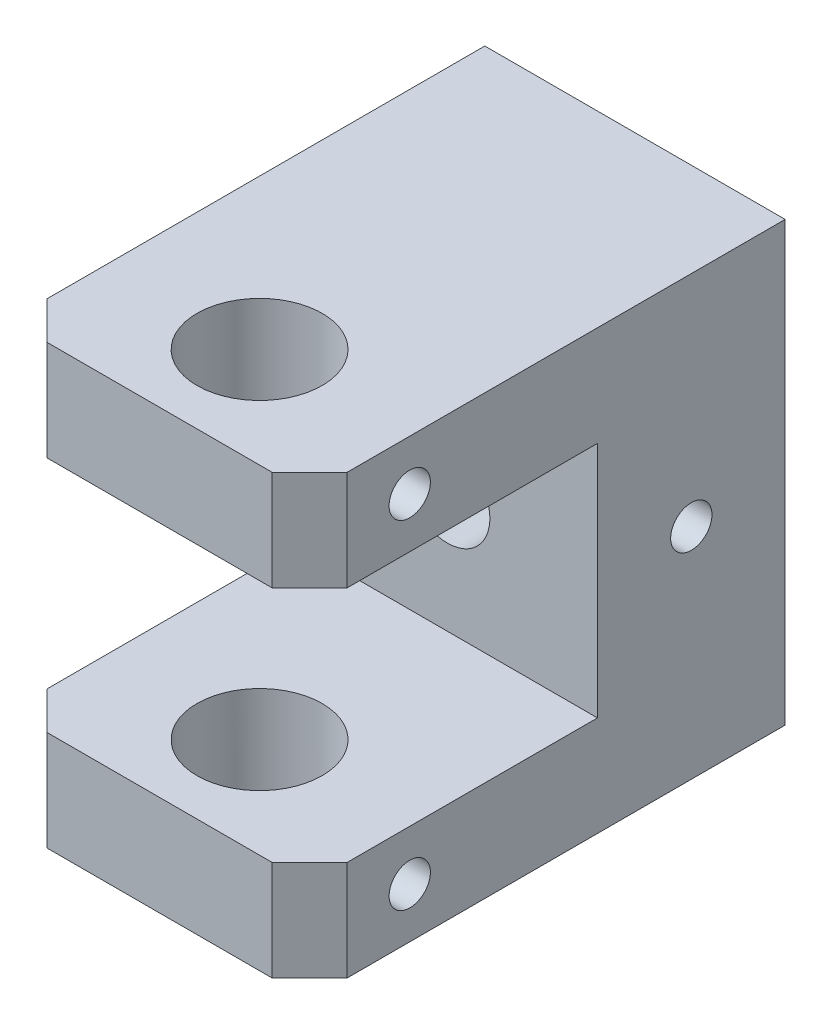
ISO-10303-21;
HEADER;
FILE_DESCRIPTION(('STEP AP214'),'2;1');
FILE_NAME('part.step','',(''),(''),'','','');
FILE_SCHEMA(('AUTOMOTIVE_DESIGN { 1 0 10303 214 1 1 1 1 }'));
ENDSEC;
DATA;
#1=APPLICATION_CONTEXT('core data for automotive mechanical design processes');
#2=APPLICATION_PROTOCOL_DEFINITION('international standard','automotive_design',2000,#1);
#3=PRODUCT_CONTEXT('',#1,'mechanical');
#4=PRODUCT('Part','Part','',(#3));
#5=PRODUCT_RELATED_PRODUCT_CATEGORY('part','',(#4));
#6=PRODUCT_DEFINITION_FORMATION('','',#4);
#7=PRODUCT_DEFINITION_CONTEXT('part definition',#1,'design');
#8=PRODUCT_DEFINITION('design','',#6,#7);
#9=PRODUCT_DEFINITION_SHAPE('','',#8);
#10=(LENGTH_UNIT() NAMED_UNIT(*) SI_UNIT(.MILLI.,.METRE.));
#11=(NAMED_UNIT(*) PLANE_ANGLE_UNIT() SI_UNIT($,.RADIAN.));
#12=(NAMED_UNIT(*) SI_UNIT($,.STERADIAN.) SOLID_ANGLE_UNIT());
#13=UNCERTAINTY_MEASURE_WITH_UNIT(LENGTH_MEASURE(1.E-05),#10,'distance_accuracy_value','');
#14=(GEOMETRIC_REPRESENTATION_CONTEXT(3) GLOBAL_UNCERTAINTY_ASSIGNED_CONTEXT((#13)) GLOBAL_UNIT_ASSIGNED_CONTEXT((#10,
#11,#12)) REPRESENTATION_CONTEXT('',''));
#15=CARTESIAN_POINT('',(0.,0.,0.));
#16=DIRECTION('',(0.,0.,1.));
#17=DIRECTION('',(1.,0.,0.));
#18=AXIS2_PLACEMENT_3D('',#15,#16,#17);
#19=CARTESIAN_POINT('',(-12.,17.5,38.));
#20=DIRECTION('',(0.,0.,-1.));
#21=DIRECTION('',(-1.,0.,0.));
#22=AXIS2_PLACEMENT_3D('',#19,#20,#21);
#23=PLANE('',#22);
#24=DIRECTION('',(1.,0.,0.));
#25=VECTOR('',#24,1.);
#26=CARTESIAN_POINT('',(-12.,17.5,38.));
#27=LINE('',#26,#25);
#28=CARTESIAN_POINT('',(-9.,17.5,38.));
#29=VERTEX_POINT('',#28);
#30=CARTESIAN_POINT('',(8.99999999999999,17.5,38.));
#31=VERTEX_POINT('',#30);
#32=EDGE_CURVE('E171',#29,#31,#27,.T.);
#33=ORIENTED_EDGE('',*,*,#32,.F.);
#34=DIRECTION('',(0.,-1.,0.));
#35=VECTOR('',#34,1.);
#36=CARTESIAN_POINT('',(-9.,17.5,38.));
#37=LINE('',#36,#35);
#38=CARTESIAN_POINT('',(-9.00000000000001,9.49999999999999,38.));
#39=VERTEX_POINT('',#38);
#40=EDGE_CURVE('E218',#29,#39,#37,.T.);
#41=ORIENTED_EDGE('',*,*,#40,.T.);
#42=DIRECTION('',(1.,0.,0.));
#43=VECTOR('',#42,1.);
#44=CARTESIAN_POINT('',(-12.,9.49999999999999,38.));
#45=LINE('',#44,#43);
#46=CARTESIAN_POINT('',(8.99999999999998,9.49999999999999,38.));
#47=VERTEX_POINT('',#46);
#48=EDGE_CURVE('E164',#39,#47,#45,.T.);
#49=ORIENTED_EDGE('',*,*,#48,.T.);
#50=DIRECTION('',(0.,1.,0.));
#51=VECTOR('',#50,1.);
#52=CARTESIAN_POINT('',(8.99999999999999,17.5,38.));
#53=LINE('',#52,#51);
#54=EDGE_CURVE('E52',#47,#31,#53,.T.);
#55=ORIENTED_EDGE('',*,*,#54,.T.);
#56=EDGE_LOOP('',(#33,#41,#49,#55));
#57=FACE_BOUND('',#56,.T.);
#58=ADVANCED_FACE('F37',(#57),#23,.F.);
#59=CARTESIAN_POINT('',(-12.,17.5,0.));
#60=DIRECTION('',(1.,0.,0.));
#61=DIRECTION('',(0.,0.,-1.));
#62=AXIS2_PLACEMENT_3D('',#59,#60,#61);
#63=PLANE('',#62);
#64=DIRECTION('',(0.,0.,1.));
#65=VECTOR('',#64,1.);
#66=CARTESIAN_POINT('',(-12.,-17.5,0.));
#67=LINE('',#66,#65);
#68=CARTESIAN_POINT('',(-12.,-17.5,0.));
#69=VERTEX_POINT('',#68);
#70=CARTESIAN_POINT('',(-12.,-17.5,35.));
#71=VERTEX_POINT('',#70);
#72=EDGE_CURVE('E166',#69,#71,#67,.T.);
#73=ORIENTED_EDGE('',*,*,#72,.T.);
#74=DIRECTION('',(0.,1.,0.));
#75=VECTOR('',#74,1.);
#76=CARTESIAN_POINT('',(-12.,17.5,35.));
#77=LINE('',#76,#75);
#78=CARTESIAN_POINT('',(-12.,-9.5,35.));
#79=VERTEX_POINT('',#78);
#80=EDGE_CURVE('E134',#71,#79,#77,.T.);
#81=ORIENTED_EDGE('',*,*,#80,.T.);
#82=DIRECTION('',(0.,0.,-1.));
#83=VECTOR('',#82,1.);
#84=CARTESIAN_POINT('',(-12.,-9.5,38.));
#85=LINE('',#84,#83);
#86=CARTESIAN_POINT('',(-12.,-9.5,15.));
#87=VERTEX_POINT('',#86);
#88=EDGE_CURVE('E126',#79,#87,#85,.T.);
#89=ORIENTED_EDGE('',*,*,#88,.T.);
#90=DIRECTION('',(0.,1.,0.));
#91=VECTOR('',#90,1.);
#92=CARTESIAN_POINT('',(-12.,9.5,15.));
#93=LINE('',#92,#91);
#94=CARTESIAN_POINT('',(-12.,9.5,15.));
#95=VERTEX_POINT('',#94);
#96=EDGE_CURVE('E132',#87,#95,#93,.T.);
#97=ORIENTED_EDGE('',*,*,#96,.T.);
#98=DIRECTION('',(0.,0.,1.));
#99=VECTOR('',#98,1.);
#100=CARTESIAN_POINT('',(-12.,9.49999999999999,38.));
#101=LINE('',#100,#99);
#102=CARTESIAN_POINT('',(-12.,9.49999999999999,35.));
#103=VERTEX_POINT('',#102);
#104=EDGE_CURVE('E153',#95,#103,#101,.T.);
#105=ORIENTED_EDGE('',*,*,#104,.T.);
#106=DIRECTION('',(0.,1.,0.));
#107=VECTOR('',#106,1.);
#108=CARTESIAN_POINT('',(-12.,17.5,35.));
#109=LINE('',#108,#107);
#110=CARTESIAN_POINT('',(-12.,17.5,35.));
#111=VERTEX_POINT('',#110);
#112=EDGE_CURVE('E214',#103,#111,#109,.T.);
#113=ORIENTED_EDGE('',*,*,#112,.T.);
#114=DIRECTION('',(0.,0.,1.));
#115=VECTOR('',#114,1.);
#116=CARTESIAN_POINT('',(-12.,17.5,0.));
#117=LINE('',#116,#115);
#118=CARTESIAN_POINT('',(-12.,17.5,0.));
#119=VERTEX_POINT('',#118);
#120=EDGE_CURVE('E169',#119,#111,#117,.T.);
#121=ORIENTED_EDGE('',*,*,#120,.F.);
#122=DIRECTION('',(0.,-1.,0.));
#123=VECTOR('',#122,1.);
#124=CARTESIAN_POINT('',(-12.,17.5,0.));
#125=LINE('',#124,#123);
#126=EDGE_CURVE('E178',#119,#69,#125,.T.);
#127=ORIENTED_EDGE('',*,*,#126,.T.);
#128=EDGE_LOOP('',(#73,#81,#89,#97,#105,#113,#121,#127));
#129=FACE_BOUND('',#128,.T.);
#130=ADVANCED_FACE('F129',(#129),#63,.F.);
#131=DIRECTION('',(1.,0.,0.));
#132=VECTOR('',#131,1.);
#133=CARTESIAN_POINT('',(-12.,-17.5,38.));
#134=LINE('',#133,#132);
#135=CARTESIAN_POINT('',(-9.,-17.5,38.));
#136=VERTEX_POINT('',#135);
#137=CARTESIAN_POINT('',(8.99999999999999,-17.5,38.));
#138=VERTEX_POINT('',#137);
#139=EDGE_CURVE('E180',#136,#138,#134,.T.);
#140=ORIENTED_EDGE('',*,*,#139,.T.);
#141=DIRECTION('',(0.,1.,0.));
#142=VECTOR('',#141,1.);
#143=CARTESIAN_POINT('',(8.99999999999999,17.5,38.));
#144=LINE('',#143,#142);
#145=CARTESIAN_POINT('',(9.,-9.5,38.));
#146=VERTEX_POINT('',#145);
#147=EDGE_CURVE('E208',#138,#146,#144,.T.);
#148=ORIENTED_EDGE('',*,*,#147,.T.);
#149=DIRECTION('',(1.,0.,0.));
#150=VECTOR('',#149,1.);
#151=CARTESIAN_POINT('',(-12.,-9.5,38.));
#152=LINE('',#151,#150);
#153=CARTESIAN_POINT('',(-9.00000000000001,-9.5,38.));
#154=VERTEX_POINT('',#153);
#155=EDGE_CURVE('E149',#154,#146,#152,.T.);
#156=ORIENTED_EDGE('',*,*,#155,.F.);
#157=DIRECTION('',(0.,-1.,0.));
#158=VECTOR('',#157,1.);
#159=CARTESIAN_POINT('',(-9.,17.5,38.));
#160=LINE('',#159,#158);
#161=EDGE_CURVE('E205',#154,#136,#160,.T.);
#162=ORIENTED_EDGE('',*,*,#161,.T.);
#163=EDGE_LOOP('',(#140,#148,#156,#162));
#164=FACE_BOUND('',#163,.T.);
#165=ADVANCED_FACE('F256',(#164),#23,.F.);
#166=CARTESIAN_POINT('',(12.,17.5,0.));
#167=DIRECTION('',(-1.,0.,0.));
#168=DIRECTION('',(0.,0.,1.));
#169=AXIS2_PLACEMENT_3D('',#166,#167,#168);
#170=PLANE('',#169);
#171=CARTESIAN_POINT('',(12.,0.,7.5));
#172=DIRECTION('',(1.,0.,0.));
#173=DIRECTION('',(0.,0.,-1.));
#174=AXIS2_PLACEMENT_3D('',#171,#172,#173);
#175=CIRCLE('',#174,1.64999999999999);
#176=CARTESIAN_POINT('',(12.,0.,5.85000000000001));
#177=VERTEX_POINT('',#176);
#178=EDGE_CURVE('E379',#177,#177,#175,.T.);
#179=ORIENTED_EDGE('',*,*,#178,.F.);
#180=EDGE_LOOP('',(#179));
#181=FACE_BOUND('',#180,.T.);
#182=CARTESIAN_POINT('',(12.,13.5,30.));
#183=DIRECTION('',(1.,0.,0.));
#184=DIRECTION('',(0.,0.,-1.));
#185=AXIS2_PLACEMENT_3D('',#182,#183,#184);
#186=CIRCLE('',#185,1.64999999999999);
#187=CARTESIAN_POINT('',(12.,13.5,28.35));
#188=VERTEX_POINT('',#187);
#189=EDGE_CURVE('E360',#188,#188,#186,.T.);
#190=ORIENTED_EDGE('',*,*,#189,.F.);
#191=EDGE_LOOP('',(#190));
#192=FACE_BOUND('',#191,.T.);
#193=CARTESIAN_POINT('',(12.,-13.5,30.));
#194=DIRECTION('',(1.,0.,0.));
#195=DIRECTION('',(0.,0.,-1.));
#196=AXIS2_PLACEMENT_3D('',#193,#194,#195);
#197=CIRCLE('',#196,1.64999999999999);
#198=CARTESIAN_POINT('',(12.,-13.5,28.35));
#199=VERTEX_POINT('',#198);
#200=EDGE_CURVE('E329',#199,#199,#197,.T.);
#201=ORIENTED_EDGE('',*,*,#200,.F.);
#202=EDGE_LOOP('',(#201));
#203=FACE_BOUND('',#202,.T.);
#204=DIRECTION('',(0.,0.,-1.));
#205=VECTOR('',#204,1.);
#206=CARTESIAN_POINT('',(12.,-9.5,38.));
#207=LINE('',#206,#205);
#208=CARTESIAN_POINT('',(12.,-9.5,35.));
#209=VERTEX_POINT('',#208);
#210=CARTESIAN_POINT('',(12.,-9.5,15.));
#211=VERTEX_POINT('',#210);
#212=EDGE_CURVE('E144',#209,#211,#207,.T.);
#213=ORIENTED_EDGE('',*,*,#212,.F.);
#214=DIRECTION('',(0.,-1.,0.));
#215=VECTOR('',#214,1.);
#216=CARTESIAN_POINT('',(12.,17.5,35.));
#217=LINE('',#216,#215);
#218=CARTESIAN_POINT('',(12.,-17.5,35.));
#219=VERTEX_POINT('',#218);
#220=EDGE_CURVE('E198',#209,#219,#217,.T.);
#221=ORIENTED_EDGE('',*,*,#220,.T.);
#222=DIRECTION('',(0.,0.,-1.));
#223=VECTOR('',#222,1.);
#224=CARTESIAN_POINT('',(12.,-17.5,0.));
#225=LINE('',#224,#223);
#226=CARTESIAN_POINT('',(12.,-17.5,0.));
#227=VERTEX_POINT('',#226);
#228=EDGE_CURVE('E183',#219,#227,#225,.T.);
#229=ORIENTED_EDGE('',*,*,#228,.T.);
#230=DIRECTION('',(0.,-1.,0.));
#231=VECTOR('',#230,1.);
#232=CARTESIAN_POINT('',(12.,17.5,0.));
#233=LINE('',#232,#231);
#234=CARTESIAN_POINT('',(12.,17.5,0.));
#235=VERTEX_POINT('',#234);
#236=EDGE_CURVE('E188',#235,#227,#233,.T.);
#237=ORIENTED_EDGE('',*,*,#236,.F.);
#238=DIRECTION('',(0.,0.,-1.));
#239=VECTOR('',#238,1.);
#240=CARTESIAN_POINT('',(12.,17.5,0.));
#241=LINE('',#240,#239);
#242=CARTESIAN_POINT('',(12.,17.5,35.));
#243=VERTEX_POINT('',#242);
#244=EDGE_CURVE('E174',#243,#235,#241,.T.);
#245=ORIENTED_EDGE('',*,*,#244,.F.);
#246=DIRECTION('',(0.,-1.,0.));
#247=VECTOR('',#246,1.);
#248=CARTESIAN_POINT('',(12.,17.5,35.));
#249=LINE('',#248,#247);
#250=CARTESIAN_POINT('',(12.,9.49999999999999,35.));
#251=VERTEX_POINT('',#250);
#252=EDGE_CURVE('E191',#243,#251,#249,.T.);
#253=ORIENTED_EDGE('',*,*,#252,.T.);
#254=DIRECTION('',(0.,0.,1.));
#255=VECTOR('',#254,1.);
#256=CARTESIAN_POINT('',(12.,9.49999999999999,38.));
#257=LINE('',#256,#255);
#258=CARTESIAN_POINT('',(12.,9.5,15.));
#259=VERTEX_POINT('',#258);
#260=EDGE_CURVE('E137',#259,#251,#257,.T.);
#261=ORIENTED_EDGE('',*,*,#260,.F.);
#262=DIRECTION('',(0.,1.,0.));
#263=VECTOR('',#262,1.);
#264=CARTESIAN_POINT('',(12.,9.5,15.));
#265=LINE('',#264,#263);
#266=EDGE_CURVE('E159',#211,#259,#265,.T.);
#267=ORIENTED_EDGE('',*,*,#266,.F.);
#268=EDGE_LOOP('',(#213,#221,#229,#237,#245,#253,#261,#267));
#269=FACE_BOUND('',#268,.T.);
#270=ADVANCED_FACE('F231',(#181,#192,#203,#269),#170,.F.);
#271=CARTESIAN_POINT('',(-12.,17.5,0.));
#272=DIRECTION('',(0.,0.,1.));
#273=DIRECTION('',(1.,0.,0.));
#274=AXIS2_PLACEMENT_3D('',#271,#272,#273);
#275=PLANE('',#274);
#276=CARTESIAN_POINT('',(0.,0.,0.));
#277=DIRECTION('',(0.,0.,-1.));
#278=DIRECTION('',(-1.,0.,0.));
#279=AXIS2_PLACEMENT_3D('',#276,#277,#278);
#280=CIRCLE('',#279,3.39999999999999);
#281=CARTESIAN_POINT('',(-3.39999999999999,0.,0.));
#282=VERTEX_POINT('',#281);
#283=EDGE_CURVE('E328',#282,#282,#280,.T.);
#284=ORIENTED_EDGE('',*,*,#283,.F.);
#285=EDGE_LOOP('',(#284));
#286=FACE_BOUND('',#285,.T.);
#287=DIRECTION('',(-1.,0.,0.));
#288=VECTOR('',#287,1.);
#289=CARTESIAN_POINT('',(-12.,-17.5,0.));
#290=LINE('',#289,#288);
#291=EDGE_CURVE('E172',#227,#69,#290,.T.);
#292=ORIENTED_EDGE('',*,*,#291,.T.);
#293=ORIENTED_EDGE('',*,*,#126,.F.);
#294=DIRECTION('',(-1.,0.,0.));
#295=VECTOR('',#294,1.);
#296=CARTESIAN_POINT('',(-12.,17.5,0.));
#297=LINE('',#296,#295);
#298=EDGE_CURVE('E176',#235,#119,#297,.T.);
#299=ORIENTED_EDGE('',*,*,#298,.F.);
#300=ORIENTED_EDGE('',*,*,#236,.T.);
#301=EDGE_LOOP('',(#292,#293,#299,#300));
#302=FACE_BOUND('',#301,.T.);
#303=ADVANCED_FACE('F244',(#286,#302),#275,.F.);
#304=CARTESIAN_POINT('',(0.,17.5,0.));
#305=DIRECTION('',(0.,1.,0.));
#306=DIRECTION('',(0.,0.,1.));
#307=AXIS2_PLACEMENT_3D('',#304,#305,#306);
#308=PLANE('',#307);
#309=CARTESIAN_POINT('',(0.,17.5,30.));
#310=DIRECTION('',(0.,1.,0.));
#311=DIRECTION('',(0.,0.,1.));
#312=AXIS2_PLACEMENT_3D('',#309,#310,#311);
#313=CIRCLE('',#312,4.99999999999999);
#314=CARTESIAN_POINT('',(0.,17.5,35.));
#315=VERTEX_POINT('',#314);
#316=EDGE_CURVE('E336',#315,#315,#313,.T.);
#317=ORIENTED_EDGE('',*,*,#316,.F.);
#318=EDGE_LOOP('',(#317));
#319=FACE_BOUND('',#318,.T.);
#320=ORIENTED_EDGE('',*,*,#120,.T.);
#321=DIRECTION('',(-0.707106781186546,0.,-0.707106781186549));
#322=VECTOR('',#321,1.);
#323=CARTESIAN_POINT('',(-23.5,17.5,23.4999999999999));
#324=LINE('',#323,#322);
#325=EDGE_CURVE('E11',#111,#29,#324,.F.);
#326=ORIENTED_EDGE('',*,*,#325,.T.);
#327=ORIENTED_EDGE('',*,*,#32,.T.);
#328=DIRECTION('',(-0.707106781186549,0.,0.707106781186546));
#329=VECTOR('',#328,1.);
#330=CARTESIAN_POINT('',(23.5,17.5,23.5000000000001));
#331=LINE('',#330,#329);
#332=EDGE_CURVE('E45',#31,#243,#331,.F.);
#333=ORIENTED_EDGE('',*,*,#332,.T.);
#334=ORIENTED_EDGE('',*,*,#244,.T.);
#335=ORIENTED_EDGE('',*,*,#298,.T.);
#336=EDGE_LOOP('',(#320,#326,#327,#333,#334,#335));
#337=FACE_BOUND('',#336,.T.);
#338=ADVANCED_FACE('F226',(#319,#337),#308,.T.);
#339=CARTESIAN_POINT('',(0.,-17.5,0.));
#340=DIRECTION('',(0.,1.,0.));
#341=DIRECTION('',(0.,0.,1.));
#342=AXIS2_PLACEMENT_3D('',#339,#340,#341);
#343=PLANE('',#342);
#344=CARTESIAN_POINT('',(0.,-17.5,30.));
#345=DIRECTION('',(0.,1.,0.));
#346=DIRECTION('',(0.,0.,1.));
#347=AXIS2_PLACEMENT_3D('',#344,#345,#346);
#348=CIRCLE('',#347,4.99999999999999);
#349=CARTESIAN_POINT('',(0.,-17.5,35.));
#350=VERTEX_POINT('',#349);
#351=EDGE_CURVE('E195',#350,#350,#348,.T.);
#352=ORIENTED_EDGE('',*,*,#351,.T.);
#353=EDGE_LOOP('',(#352));
#354=FACE_BOUND('',#353,.T.);
#355=ORIENTED_EDGE('',*,*,#228,.F.);
#356=DIRECTION('',(0.707106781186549,0.,-0.707106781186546));
#357=VECTOR('',#356,1.);
#358=CARTESIAN_POINT('',(12.,-17.5,35.));
#359=LINE('',#358,#357);
#360=EDGE_CURVE('E203',#219,#138,#359,.F.);
#361=ORIENTED_EDGE('',*,*,#360,.T.);
#362=ORIENTED_EDGE('',*,*,#139,.F.);
#363=DIRECTION('',(0.707106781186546,0.,0.707106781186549));
#364=VECTOR('',#363,1.);
#365=CARTESIAN_POINT('',(-9.,-17.5,38.));
#366=LINE('',#365,#364);
#367=EDGE_CURVE('E201',#136,#71,#366,.F.);
#368=ORIENTED_EDGE('',*,*,#367,.T.);
#369=ORIENTED_EDGE('',*,*,#72,.F.);
#370=ORIENTED_EDGE('',*,*,#291,.F.);
#371=EDGE_LOOP('',(#355,#361,#362,#368,#369,#370));
#372=FACE_BOUND('',#371,.T.);
#373=ADVANCED_FACE('F249',(#354,#372),#343,.F.);
#374=CARTESIAN_POINT('',(-12.,9.49999999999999,38.));
#375=DIRECTION('',(0.,1.,0.));
#376=DIRECTION('',(0.,0.,1.));
#377=AXIS2_PLACEMENT_3D('',#374,#375,#376);
#378=PLANE('',#377);
#379=CARTESIAN_POINT('',(0.,9.49999999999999,30.));
#380=DIRECTION('',(0.,1.,0.));
#381=DIRECTION('',(0.,0.,1.));
#382=AXIS2_PLACEMENT_3D('',#379,#380,#381);
#383=CIRCLE('',#382,4.99999999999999);
#384=CARTESIAN_POINT('',(0.,9.49999999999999,35.));
#385=VERTEX_POINT('',#384);
#386=EDGE_CURVE('E160',#385,#385,#383,.T.);
#387=ORIENTED_EDGE('',*,*,#386,.T.);
#388=EDGE_LOOP('',(#387));
#389=FACE_BOUND('',#388,.T.);
#390=ORIENTED_EDGE('',*,*,#48,.F.);
#391=DIRECTION('',(0.707106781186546,0.,0.707106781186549));
#392=VECTOR('',#391,1.);
#393=CARTESIAN_POINT('',(-9.,9.49999999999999,38.));
#394=LINE('',#393,#392);
#395=EDGE_CURVE('E223',#39,#103,#394,.F.);
#396=ORIENTED_EDGE('',*,*,#395,.T.);
#397=ORIENTED_EDGE('',*,*,#104,.F.);
#398=DIRECTION('',(1.,0.,0.));
#399=VECTOR('',#398,1.);
#400=CARTESIAN_POINT('',(-12.,9.5,15.));
#401=LINE('',#400,#399);
#402=EDGE_CURVE('E148',#95,#259,#401,.T.);
#403=ORIENTED_EDGE('',*,*,#402,.T.);
#404=ORIENTED_EDGE('',*,*,#260,.T.);
#405=DIRECTION('',(0.707106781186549,0.,-0.707106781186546));
#406=VECTOR('',#405,1.);
#407=CARTESIAN_POINT('',(12.,9.49999999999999,35.));
#408=LINE('',#407,#406);
#409=EDGE_CURVE('E221',#251,#47,#408,.F.);
#410=ORIENTED_EDGE('',*,*,#409,.T.);
#411=EDGE_LOOP('',(#390,#396,#397,#403,#404,#410));
#412=FACE_BOUND('',#411,.T.);
#413=ADVANCED_FACE('F236',(#389,#412),#378,.F.);
#414=CARTESIAN_POINT('',(-12.,9.5,15.));
#415=DIRECTION('',(0.,0.,-1.));
#416=DIRECTION('',(-1.,0.,0.));
#417=AXIS2_PLACEMENT_3D('',#414,#415,#416);
#418=PLANE('',#417);
#419=CARTESIAN_POINT('',(0.,0.,15.));
#420=DIRECTION('',(0.,0.,-1.));
#421=DIRECTION('',(-1.,0.,0.));
#422=AXIS2_PLACEMENT_3D('',#419,#420,#421);
#423=CIRCLE('',#422,3.39999999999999);
#424=CARTESIAN_POINT('',(-3.39999999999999,0.,15.));
#425=VERTEX_POINT('',#424);
#426=EDGE_CURVE('E333',#425,#425,#423,.T.);
#427=ORIENTED_EDGE('',*,*,#426,.T.);
#428=EDGE_LOOP('',(#427));
#429=FACE_BOUND('',#428,.T.);
#430=ORIENTED_EDGE('',*,*,#266,.T.);
#431=ORIENTED_EDGE('',*,*,#402,.F.);
#432=ORIENTED_EDGE('',*,*,#96,.F.);
#433=DIRECTION('',(1.,0.,0.));
#434=VECTOR('',#433,1.);
#435=CARTESIAN_POINT('',(-12.,-9.5,15.));
#436=LINE('',#435,#434);
#437=EDGE_CURVE('E140',#87,#211,#436,.T.);
#438=ORIENTED_EDGE('',*,*,#437,.T.);
#439=EDGE_LOOP('',(#430,#431,#432,#438));
#440=FACE_BOUND('',#439,.T.);
#441=ADVANCED_FACE('F151',(#429,#440),#418,.F.);
#442=CARTESIAN_POINT('',(-12.,-9.5,38.));
#443=DIRECTION('',(0.,-1.,0.));
#444=DIRECTION('',(0.,0.,-1.));
#445=AXIS2_PLACEMENT_3D('',#442,#443,#444);
#446=PLANE('',#445);
#447=CARTESIAN_POINT('',(0.,-9.5,30.));
#448=DIRECTION('',(0.,-1.,0.));
#449=DIRECTION('',(0.,0.,-1.));
#450=AXIS2_PLACEMENT_3D('',#447,#448,#449);
#451=CIRCLE('',#450,4.99999999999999);
#452=CARTESIAN_POINT('',(0.,-9.5,25.));
#453=VERTEX_POINT('',#452);
#454=EDGE_CURVE('E192',#453,#453,#451,.T.);
#455=ORIENTED_EDGE('',*,*,#454,.T.);
#456=EDGE_LOOP('',(#455));
#457=FACE_BOUND('',#456,.T.);
#458=ORIENTED_EDGE('',*,*,#155,.T.);
#459=DIRECTION('',(-0.707106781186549,0.,0.707106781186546));
#460=VECTOR('',#459,1.);
#461=CARTESIAN_POINT('',(12.,-9.5,35.));
#462=LINE('',#461,#460);
#463=EDGE_CURVE('E212',#146,#209,#462,.F.);
#464=ORIENTED_EDGE('',*,*,#463,.T.);
#465=ORIENTED_EDGE('',*,*,#212,.T.);
#466=ORIENTED_EDGE('',*,*,#437,.F.);
#467=ORIENTED_EDGE('',*,*,#88,.F.);
#468=DIRECTION('',(-0.707106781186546,0.,-0.707106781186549));
#469=VECTOR('',#468,1.);
#470=CARTESIAN_POINT('',(-9.,-9.5,38.));
#471=LINE('',#470,#469);
#472=EDGE_CURVE('E210',#79,#154,#471,.F.);
#473=ORIENTED_EDGE('',*,*,#472,.T.);
#474=EDGE_LOOP('',(#458,#464,#465,#466,#467,#473));
#475=FACE_BOUND('',#474,.T.);
#476=ADVANCED_FACE('F142',(#457,#475),#446,.F.);
#477=CARTESIAN_POINT('',(0.,17.5,30.));
#478=DIRECTION('',(0.,1.,0.));
#479=DIRECTION('',(0.,0.,1.));
#480=AXIS2_PLACEMENT_3D('',#477,#478,#479);
#481=CYLINDRICAL_SURFACE('',#480,4.99999999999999);
#482=CARTESIAN_POINT('',(4.71990466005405,-13.5,28.35));
#483=CARTESIAN_POINT('',(4.71990452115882,-13.4100706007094,28.349999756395));
#484=CARTESIAN_POINT('',(4.72250292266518,-13.3201423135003,28.3573769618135));
#485=CARTESIAN_POINT('',(4.73256311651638,-13.1429463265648,28.3865938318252));
#486=CARTESIAN_POINT('',(4.74002579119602,-13.0556791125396,28.4084361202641));
#487=CARTESIAN_POINT('',(4.75887919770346,-12.8864003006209,28.4657353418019));
#488=CARTESIAN_POINT('',(4.77026235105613,-12.8043789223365,28.5011660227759));
#489=CARTESIAN_POINT('',(4.79566317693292,-12.6474185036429,28.5845469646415));
#490=CARTESIAN_POINT('',(4.80968141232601,-12.5724809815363,28.6324999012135));
#491=CARTESIAN_POINT('',(4.83937566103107,-12.4289423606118,28.7415334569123));
#492=CARTESIAN_POINT('',(4.85509238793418,-12.3606525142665,28.8030128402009));
#493=CARTESIAN_POINT('',(4.8860682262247,-12.2351407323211,28.9365027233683));
#494=CARTESIAN_POINT('',(4.90132726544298,-12.177920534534,29.0085148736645));
#495=CARTESIAN_POINT('',(4.93013890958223,-12.0747664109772,29.1632957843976));
#496=CARTESIAN_POINT('',(4.94363804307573,-12.0291576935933,29.2462921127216));
#497=CARTESIAN_POINT('',(4.96692987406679,-11.9526712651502,29.4193003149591));
#498=CARTESIAN_POINT('',(4.9767235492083,-11.9217896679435,29.5093103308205));
#499=CARTESIAN_POINT('',(4.99121262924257,-11.8766869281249,29.6905281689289));
#500=CARTESIAN_POINT('',(4.99607073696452,-11.8619327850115,29.7815900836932));
#501=CARTESIAN_POINT('',(5.00071837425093,-11.8478100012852,29.9650179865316));
#502=CARTESIAN_POINT('',(5.00050918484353,-11.8484374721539,30.0573836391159));
#503=CARTESIAN_POINT('',(4.99515654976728,-11.8647199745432,30.2370279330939));
#504=CARTESIAN_POINT('',(4.99020313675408,-11.8797962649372,30.3243656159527));
#505=CARTESIAN_POINT('',(4.97615641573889,-11.9235926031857,30.495193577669));
#506=CARTESIAN_POINT('',(4.96706282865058,-11.9523135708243,30.5786835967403));
#507=CARTESIAN_POINT('',(4.94551338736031,-12.0229273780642,30.7407231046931));
#508=CARTESIAN_POINT('',(4.93301533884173,-12.0649866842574,30.8191942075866));
#509=CARTESIAN_POINT('',(4.90596050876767,-12.1609466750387,30.9681374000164));
#510=CARTESIAN_POINT('',(4.89140316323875,-12.2148506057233,31.0386072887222));
#511=CARTESIAN_POINT('',(4.86097294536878,-12.3358951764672,31.1729917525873));
#512=CARTESIAN_POINT('',(4.84507036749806,-12.4035323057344,31.2364530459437));
#513=CARTESIAN_POINT('',(4.81431124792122,-12.5486265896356,31.3512770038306));
#514=CARTESIAN_POINT('',(4.79945486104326,-12.6260851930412,31.4026378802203));
#515=CARTESIAN_POINT('',(4.77230967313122,-12.7900343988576,31.4924138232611));
#516=CARTESIAN_POINT('',(4.76005891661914,-12.8766343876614,31.5306415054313));
#517=CARTESIAN_POINT('',(4.73995346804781,-13.0555476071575,31.5918198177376));
#518=CARTESIAN_POINT('',(4.73209697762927,-13.1478584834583,31.6147766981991));
#519=CARTESIAN_POINT('',(4.72207527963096,-13.3311901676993,31.6438468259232));
#520=CARTESIAN_POINT('',(4.71967327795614,-13.4220868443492,31.6506614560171));
#521=CARTESIAN_POINT('',(4.72017136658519,-13.6037378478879,31.6492374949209));
#522=CARTESIAN_POINT('',(4.72307051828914,-13.6944921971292,31.6410015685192));
#523=CARTESIAN_POINT('',(4.73360855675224,-13.8701200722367,31.6103399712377));
#524=CARTESIAN_POINT('',(4.74108573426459,-13.9550887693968,31.5883979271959));
#525=CARTESIAN_POINT('',(4.75976051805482,-14.1201226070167,31.531525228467));
#526=CARTESIAN_POINT('',(4.77095877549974,-14.2001868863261,31.4965923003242));
#527=CARTESIAN_POINT('',(4.7962472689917,-14.3559100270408,31.4134884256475));
#528=CARTESIAN_POINT('',(4.81041691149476,-14.4313531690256,31.3649380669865));
#529=CARTESIAN_POINT('',(4.83989585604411,-14.5732756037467,31.2564095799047));
#530=CARTESIAN_POINT('',(4.85520548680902,-14.6397522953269,31.1964281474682));
#531=CARTESIAN_POINT('',(4.88610989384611,-14.7650831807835,31.0633912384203));
#532=CARTESIAN_POINT('',(4.9016842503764,-14.8234322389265,30.989853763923));
#533=CARTESIAN_POINT('',(4.93065204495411,-14.9269926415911,30.8336491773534));
#534=CARTESIAN_POINT('',(4.94404556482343,-14.9722044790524,30.7509824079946));
#535=CARTESIAN_POINT('',(4.96707750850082,-15.0477889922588,30.5792957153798));
#536=CARTESIAN_POINT('',(4.97674084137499,-15.0782604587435,30.4903228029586));
#537=CARTESIAN_POINT('',(4.99133146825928,-15.1236866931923,30.3081347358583));
#538=CARTESIAN_POINT('',(4.99626043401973,-15.1386469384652,30.2149210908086));
#539=CARTESIAN_POINT('',(5.00070328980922,-15.1521408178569,30.0315225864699));
#540=CARTESIAN_POINT('',(5.00045646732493,-15.1514003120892,29.9413963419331));
#541=CARTESIAN_POINT('',(4.99516201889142,-15.1352984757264,29.7626119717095));
#542=CARTESIAN_POINT('',(4.99011476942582,-15.1199382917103,29.673953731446));
#543=CARTESIAN_POINT('',(4.97587240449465,-15.0755116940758,29.5019703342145));
#544=CARTESIAN_POINT('',(4.96674195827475,-15.0466586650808,29.4185843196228));
#545=CARTESIAN_POINT('',(4.94527347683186,-14.9762621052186,29.2578031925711));
#546=CARTESIAN_POINT('',(4.93293486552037,-14.9347162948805,29.1804091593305));
#547=CARTESIAN_POINT('',(4.9057637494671,-14.8383673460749,29.030731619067));
#548=CARTESIAN_POINT('',(4.89085668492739,-14.783135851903,28.9587375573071));
#549=CARTESIAN_POINT('',(4.86041514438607,-14.6617163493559,28.8248018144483));
#550=CARTESIAN_POINT('',(4.84488047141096,-14.5955248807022,28.7628633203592));
#551=CARTESIAN_POINT('',(4.81423121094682,-14.4510441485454,28.6483982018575));
#552=CARTESIAN_POINT('',(4.79915525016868,-14.3723897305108,28.5963207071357));
#553=CARTESIAN_POINT('',(4.77186368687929,-14.2069783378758,28.5061637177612));
#554=CARTESIAN_POINT('',(4.75964726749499,-14.1202236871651,28.4680802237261));
#555=CARTESIAN_POINT('',(4.74014636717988,-13.9456567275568,28.4087926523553));
#556=CARTESIAN_POINT('',(4.73263920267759,-13.8581319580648,28.3868164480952));
#557=CARTESIAN_POINT('',(4.72251921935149,-13.6804038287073,28.3574226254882));
#558=CARTESIAN_POINT('',(4.71990479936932,-13.5902013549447,28.3500002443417));
#559=CARTESIAN_POINT('',(4.71990466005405,-13.5,28.35));
#560=B_SPLINE_CURVE_WITH_KNOTS('',3,(#482,#483,#484,#485,#486,#487,#488,#489,#490,#491,#492,
#493,#494,#495,#496,#497,#498,#499,#500,#501,#502,#503,#504,#505,#506,#507,#508,#509,#510,#511,
#512,#513,#514,#515,#516,#517,#518,#519,#520,#521,#522,#523,#524,#525,#526,#527,#528,#529,#530,
#531,#532,#533,#534,#535,#536,#537,#538,#539,#540,#541,#542,#543,#544,#545,#546,#547,#548,#549,
#550,#551,#552,#553,#554,#555,#556,#557,#558,#559),.UNSPECIFIED.,.T.,.F.,(4,2,2,2,2,2,2,2,2,2,2,
2,2,2,2,2,2,2,2,2,2,2,2,2,2,2,2,2,2,2,2,2,2,2,2,2,2,2,4),(0.,0.269454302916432,
0.538957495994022,0.807942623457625,1.07698527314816,1.35539043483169,1.63383926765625,
1.91939248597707,2.20487031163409,2.48059787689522,2.75625573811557,3.02131448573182,
3.28639110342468,3.55491555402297,3.82351368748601,4.10452131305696,4.38557043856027,
4.67047751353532,4.95526790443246,5.22743703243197,5.49955797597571,5.76258081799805,
6.02564971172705,6.29693565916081,6.56830013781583,6.85241935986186,7.13652791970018,
7.41870503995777,7.70078248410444,7.96984890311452,8.23889422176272,8.50382155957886,
8.76879650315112,9.04343817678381,9.3181667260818,9.60337461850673,9.8885009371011,
10.1588585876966,10.4291277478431),.UNSPECIFIED.);
#561=CARTESIAN_POINT('',(4.71990466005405,-13.5,28.35));
#562=VERTEX_POINT('',#561);
#563=EDGE_CURVE('E322',#562,#562,#560,.T.);
#564=ORIENTED_EDGE('',*,*,#563,.T.);
#565=EDGE_LOOP('',(#564));
#566=FACE_BOUND('',#565,.T.);
#567=ORIENTED_EDGE('',*,*,#351,.F.);
#568=EDGE_LOOP('',(#567));
#569=FACE_BOUND('',#568,.T.);
#570=ORIENTED_EDGE('',*,*,#454,.F.);
#571=EDGE_LOOP('',(#570));
#572=FACE_BOUND('',#571,.T.);
#573=ADVANCED_FACE('F301',(#566,#569,#572),#481,.F.);
#574=CARTESIAN_POINT('',(4.71990466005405,13.5,28.35));
#575=CARTESIAN_POINT('',(4.71990452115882,13.5899293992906,28.349999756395));
#576=CARTESIAN_POINT('',(4.72250292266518,13.6798576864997,28.3573769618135));
#577=CARTESIAN_POINT('',(4.73256311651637,13.8570536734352,28.3865938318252));
#578=CARTESIAN_POINT('',(4.74002579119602,13.9443208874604,28.4084361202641));
#579=CARTESIAN_POINT('',(4.75887919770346,14.1135996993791,28.4657353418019));
#580=CARTESIAN_POINT('',(4.77026235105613,14.1956210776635,28.5011660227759));
#581=CARTESIAN_POINT('',(4.79566317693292,14.3525814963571,28.5845469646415));
#582=CARTESIAN_POINT('',(4.80968141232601,14.4275190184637,28.6324999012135));
#583=CARTESIAN_POINT('',(4.83937566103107,14.5710576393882,28.7415334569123));
#584=CARTESIAN_POINT('',(4.85509238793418,14.6393474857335,28.8030128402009));
#585=CARTESIAN_POINT('',(4.8860682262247,14.7648592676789,28.9365027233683));
#586=CARTESIAN_POINT('',(4.90132726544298,14.822079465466,29.0085148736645));
#587=CARTESIAN_POINT('',(4.93013890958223,14.9252335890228,29.1632957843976));
#588=CARTESIAN_POINT('',(4.94363804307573,14.9708423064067,29.2462921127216));
#589=CARTESIAN_POINT('',(4.96692987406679,15.0473287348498,29.4193003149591));
#590=CARTESIAN_POINT('',(4.9767235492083,15.0782103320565,29.5093103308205));
#591=CARTESIAN_POINT('',(4.99121262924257,15.1233130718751,29.6905281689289));
#592=CARTESIAN_POINT('',(4.99607073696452,15.1380672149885,29.7815900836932));
#593=CARTESIAN_POINT('',(5.00071837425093,15.1521899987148,29.9650179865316));
#594=CARTESIAN_POINT('',(5.00050918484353,15.1515625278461,30.0573836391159));
#595=CARTESIAN_POINT('',(4.99515654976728,15.1352800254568,30.2370279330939));
#596=CARTESIAN_POINT('',(4.99020313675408,15.1202037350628,30.3243656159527));
#597=CARTESIAN_POINT('',(4.97615641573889,15.0764073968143,30.495193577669));
#598=CARTESIAN_POINT('',(4.96706282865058,15.0476864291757,30.5786835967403));
#599=CARTESIAN_POINT('',(4.94551338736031,14.9770726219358,30.7407231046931));
#600=CARTESIAN_POINT('',(4.93301533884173,14.9350133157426,30.8191942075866));
#601=CARTESIAN_POINT('',(4.90596050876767,14.8390533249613,30.9681374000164));
#602=CARTESIAN_POINT('',(4.89140316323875,14.7851493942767,31.0386072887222));
#603=CARTESIAN_POINT('',(4.86097294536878,14.6641048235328,31.1729917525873));
#604=CARTESIAN_POINT('',(4.84507036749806,14.5964676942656,31.2364530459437));
#605=CARTESIAN_POINT('',(4.81431124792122,14.4513734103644,31.3512770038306));
#606=CARTESIAN_POINT('',(4.79945486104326,14.3739148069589,31.4026378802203));
#607=CARTESIAN_POINT('',(4.77230967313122,14.2099656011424,31.4924138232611));
#608=CARTESIAN_POINT('',(4.76005891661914,14.1233656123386,31.5306415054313));
#609=CARTESIAN_POINT('',(4.73995346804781,13.9444523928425,31.5918198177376));
#610=CARTESIAN_POINT('',(4.73209697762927,13.8521415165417,31.6147766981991));
#611=CARTESIAN_POINT('',(4.72207527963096,13.6688098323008,31.6438468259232));
#612=CARTESIAN_POINT('',(4.71967327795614,13.5779131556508,31.6506614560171));
#613=CARTESIAN_POINT('',(4.72017136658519,13.3962621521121,31.6492374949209));
#614=CARTESIAN_POINT('',(4.72307051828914,13.3055078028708,31.6410015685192));
#615=CARTESIAN_POINT('',(4.73360855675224,13.1298799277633,31.6103399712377));
#616=CARTESIAN_POINT('',(4.74108573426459,13.0449112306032,31.5883979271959));
#617=CARTESIAN_POINT('',(4.75976051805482,12.8798773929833,31.531525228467));
#618=CARTESIAN_POINT('',(4.77095877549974,12.7998131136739,31.4965923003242));
#619=CARTESIAN_POINT('',(4.7962472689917,12.6440899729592,31.4134884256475));
#620=CARTESIAN_POINT('',(4.81041691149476,12.5686468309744,31.3649380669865));
#621=CARTESIAN_POINT('',(4.83989585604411,12.4267243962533,31.2564095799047));
#622=CARTESIAN_POINT('',(4.85520548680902,12.3602477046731,31.1964281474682));
#623=CARTESIAN_POINT('',(4.88610989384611,12.2349168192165,31.0633912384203));
#624=CARTESIAN_POINT('',(4.9016842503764,12.1765677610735,30.989853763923));
#625=CARTESIAN_POINT('',(4.93065204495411,12.0730073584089,30.8336491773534));
#626=CARTESIAN_POINT('',(4.94404556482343,12.0277955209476,30.7509824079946));
#627=CARTESIAN_POINT('',(4.96707750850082,11.9522110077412,30.5792957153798));
#628=CARTESIAN_POINT('',(4.97674084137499,11.9217395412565,30.4903228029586));
#629=CARTESIAN_POINT('',(4.99133146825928,11.8763133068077,30.3081347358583));
#630=CARTESIAN_POINT('',(4.99626043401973,11.8613530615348,30.2149210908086));
#631=CARTESIAN_POINT('',(5.00070328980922,11.8478591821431,30.0315225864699));
#632=CARTESIAN_POINT('',(5.00045646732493,11.8485996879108,29.9413963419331));
#633=CARTESIAN_POINT('',(4.99516201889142,11.8647015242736,29.7626119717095));
#634=CARTESIAN_POINT('',(4.99011476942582,11.8800617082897,29.673953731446));
#635=CARTESIAN_POINT('',(4.97587240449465,11.9244883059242,29.5019703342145));
#636=CARTESIAN_POINT('',(4.96674195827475,11.9533413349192,29.4185843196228));
#637=CARTESIAN_POINT('',(4.94527347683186,12.0237378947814,29.2578031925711));
#638=CARTESIAN_POINT('',(4.93293486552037,12.0652837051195,29.1804091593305));
#639=CARTESIAN_POINT('',(4.9057637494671,12.1616326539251,29.030731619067));
#640=CARTESIAN_POINT('',(4.89085668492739,12.216864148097,28.9587375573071));
#641=CARTESIAN_POINT('',(4.86041514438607,12.3382836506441,28.8248018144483));
#642=CARTESIAN_POINT('',(4.84488047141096,12.4044751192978,28.7628633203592));
#643=CARTESIAN_POINT('',(4.81423121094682,12.5489558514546,28.6483982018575));
#644=CARTESIAN_POINT('',(4.79915525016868,12.6276102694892,28.5963207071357));
#645=CARTESIAN_POINT('',(4.77186368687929,12.7930216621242,28.5061637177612));
#646=CARTESIAN_POINT('',(4.75964726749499,12.8797763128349,28.4680802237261));
#647=CARTESIAN_POINT('',(4.74014636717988,13.0543432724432,28.4087926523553));
#648=CARTESIAN_POINT('',(4.73263920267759,13.1418680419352,28.3868164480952));
#649=CARTESIAN_POINT('',(4.72251921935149,13.3195961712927,28.3574226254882));
#650=CARTESIAN_POINT('',(4.71990479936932,13.4097986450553,28.3500002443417));
#651=CARTESIAN_POINT('',(4.71990466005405,13.5,28.35));
#652=B_SPLINE_CURVE_WITH_KNOTS('',3,(#574,#575,#576,#577,#578,#579,#580,#581,#582,#583,#584,
#585,#586,#587,#588,#589,#590,#591,#592,#593,#594,#595,#596,#597,#598,#599,#600,#601,#602,#603,
#604,#605,#606,#607,#608,#609,#610,#611,#612,#613,#614,#615,#616,#617,#618,#619,#620,#621,#622,
#623,#624,#625,#626,#627,#628,#629,#630,#631,#632,#633,#634,#635,#636,#637,#638,#639,#640,#641,
#642,#643,#644,#645,#646,#647,#648,#649,#650,#651),.UNSPECIFIED.,.T.,.F.,(4,2,2,2,2,2,2,2,2,2,2,
2,2,2,2,2,2,2,2,2,2,2,2,2,2,2,2,2,2,2,2,2,2,2,2,2,2,2,4),(0.,0.26945430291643,0.538957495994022,
0.807942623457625,1.07698527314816,1.35539043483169,1.63383926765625,1.91939248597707,
2.20487031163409,2.48059787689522,2.75625573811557,3.02131448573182,3.28639110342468,
3.55491555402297,3.82351368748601,4.10452131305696,4.38557043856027,4.67047751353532,
4.95526790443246,5.22743703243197,5.49955797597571,5.76258081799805,6.02564971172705,
6.29693565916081,6.56830013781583,6.85241935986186,7.13652791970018,7.41870503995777,
7.70078248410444,7.96984890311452,8.23889422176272,8.50382155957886,8.76879650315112,
9.04343817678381,9.3181667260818,9.60337461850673,9.8885009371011,10.1588585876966,
10.4291277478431),.UNSPECIFIED.);
#653=CARTESIAN_POINT('',(4.71990466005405,13.5,28.35));
#654=VERTEX_POINT('',#653);
#655=EDGE_CURVE('E358',#654,#654,#652,.T.);
#656=ORIENTED_EDGE('',*,*,#655,.T.);
#657=EDGE_LOOP('',(#656));
#658=FACE_BOUND('',#657,.T.);
#659=ORIENTED_EDGE('',*,*,#316,.T.);
#660=EDGE_LOOP('',(#659));
#661=FACE_BOUND('',#660,.T.);
#662=ORIENTED_EDGE('',*,*,#386,.F.);
#663=EDGE_LOOP('',(#662));
#664=FACE_BOUND('',#663,.T.);
#665=ADVANCED_FACE('F309',(#658,#661,#664),#481,.F.);
#666=CARTESIAN_POINT('',(0.,0.,0.));
#667=DIRECTION('',(0.,0.,-1.));
#668=DIRECTION('',(-1.,0.,0.));
#669=AXIS2_PLACEMENT_3D('',#666,#667,#668);
#670=CYLINDRICAL_SURFACE('',#669,3.39999999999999);
#671=CARTESIAN_POINT('',(3.39999999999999,0.,5.85));
#672=CARTESIAN_POINT('',(3.39999554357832,0.0870467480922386,5.85000520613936));
#673=CARTESIAN_POINT('',(3.39662084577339,0.17420627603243,5.85692885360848));
#674=CARTESIAN_POINT('',(3.38345425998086,0.345968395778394,5.88432623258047));
#675=CARTESIAN_POINT('',(3.37364925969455,0.430565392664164,5.90482765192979));
#676=CARTESIAN_POINT('',(3.34865237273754,0.594452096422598,5.95840023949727));
#677=CARTESIAN_POINT('',(3.33348101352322,0.673760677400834,5.99142354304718));
#678=CARTESIAN_POINT('',(3.29915851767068,0.82560347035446,6.06886437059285));
#679=CARTESIAN_POINT('',(3.28000784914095,0.898138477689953,6.1132805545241));
#680=CARTESIAN_POINT('',(3.23820499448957,1.0391066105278,6.21518327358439));
#681=CARTESIAN_POINT('',(3.2154141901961,1.10705827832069,6.27327818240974));
#682=CARTESIAN_POINT('',(3.16937748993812,1.23269282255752,6.39958520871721));
#683=CARTESIAN_POINT('',(3.14613128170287,1.29036835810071,6.46780449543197));
#684=CARTESIAN_POINT('',(3.09989824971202,1.39796419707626,6.61832278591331));
#685=CARTESIAN_POINT('',(3.0770504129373,1.44702801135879,6.70128164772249));
#686=CARTESIAN_POINT('',(3.03650181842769,1.53029949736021,6.87551038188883));
#687=CARTESIAN_POINT('',(3.0187975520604,1.56451730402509,6.96677453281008));
#688=CARTESIAN_POINT('',(2.99209310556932,1.61497874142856,7.14957512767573));
#689=CARTESIAN_POINT('',(2.9826461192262,1.63215298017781,7.24078626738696));
#690=CARTESIAN_POINT('',(2.97231275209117,1.65090425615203,7.42524485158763));
#691=CARTESIAN_POINT('',(2.97141875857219,1.65249516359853,7.51849041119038));
#692=CARTESIAN_POINT('',(2.97792903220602,1.64071993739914,7.69325622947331));
#693=CARTESIAN_POINT('',(2.98442303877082,1.62899473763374,7.77492893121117));
#694=CARTESIAN_POINT('',(3.00339304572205,1.5937461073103,7.93495940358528));
#695=CARTESIAN_POINT('',(3.01587077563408,1.57021926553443,8.01331620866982));
#696=CARTESIAN_POINT('',(3.04568519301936,1.51158855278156,8.16671107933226));
#697=CARTESIAN_POINT('',(3.06312833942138,1.47622766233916,8.24162924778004));
#698=CARTESIAN_POINT('',(3.1009069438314,1.39512550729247,8.38481810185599));
#699=CARTESIAN_POINT('',(3.1212436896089,1.34937961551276,8.45308580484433));
#700=CARTESIAN_POINT('',(3.1654349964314,1.24247523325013,8.58955514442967));
#701=CARTESIAN_POINT('',(3.18942080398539,1.18013258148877,8.65678980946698));
#702=CARTESIAN_POINT('',(3.2362392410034,1.04492764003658,8.78023850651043));
#703=CARTESIAN_POINT('',(3.25907137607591,0.972060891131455,8.83644784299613));
#704=CARTESIAN_POINT('',(3.30216919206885,0.81403327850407,8.9384181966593));
#705=CARTESIAN_POINT('',(3.32228949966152,0.728488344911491,8.98365035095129));
#706=CARTESIAN_POINT('',(3.35648552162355,0.549777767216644,9.05872302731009));
#707=CARTESIAN_POINT('',(3.37056576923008,0.456617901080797,9.08857509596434));
#708=CARTESIAN_POINT('',(3.39015324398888,0.273269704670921,9.12970460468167));
#709=CARTESIAN_POINT('',(3.39625317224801,0.183434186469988,9.14227035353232));
#710=CARTESIAN_POINT('',(3.40119789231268,0.00273518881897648,9.1524740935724));
#711=CARTESIAN_POINT('',(3.4000458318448,-0.0881278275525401,9.15011856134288));
#712=CARTESIAN_POINT('',(3.39097048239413,-0.261353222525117,9.13132988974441));
#713=CARTESIAN_POINT('',(3.38354105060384,-0.343856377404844,9.11592328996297));
#714=CARTESIAN_POINT('',(3.36327450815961,-0.504954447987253,9.0730452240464));
#715=CARTESIAN_POINT('',(3.35043678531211,-0.583548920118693,9.04557239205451));
#716=CARTESIAN_POINT('',(3.32005095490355,-0.73728372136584,8.97856506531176));
#717=CARTESIAN_POINT('',(3.30237432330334,-0.812252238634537,8.93869670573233));
#718=CARTESIAN_POINT('',(3.26404831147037,-0.954692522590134,8.84839967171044));
#719=CARTESIAN_POINT('',(3.24339763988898,-1.02216101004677,8.79796640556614));
#720=CARTESIAN_POINT('',(3.19886180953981,-1.15438028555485,8.68250322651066));
#721=CARTESIAN_POINT('',(3.17485488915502,-1.21828399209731,8.61654836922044));
#722=CARTESIAN_POINT('',(3.12779784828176,-1.33447304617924,8.4747267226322));
#723=CARTESIAN_POINT('',(3.10474830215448,-1.38675149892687,8.39885409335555));
#724=CARTESIAN_POINT('',(3.06134238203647,-1.48018597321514,8.23536844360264));
#725=CARTESIAN_POINT('',(3.0411351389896,-1.52079821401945,8.14740165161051));
#726=CARTESIAN_POINT('',(3.00754238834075,-1.58621001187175,7.96457853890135));
#727=CARTESIAN_POINT('',(2.99414862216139,-1.61102872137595,7.8697307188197));
#728=CARTESIAN_POINT('',(2.97728894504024,-1.641960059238,7.68538029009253));
#729=CARTESIAN_POINT('',(2.97300958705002,-1.6496090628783,7.59621091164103));
#730=CARTESIAN_POINT('',(2.97259353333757,-1.65036116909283,7.41780599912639));
#731=CARTESIAN_POINT('',(2.97645393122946,-1.64346946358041,7.32857050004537));
#732=CARTESIAN_POINT('',(2.9910390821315,-1.61675014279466,7.16052579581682));
#733=CARTESIAN_POINT('',(3.00115314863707,-1.59807060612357,7.08147465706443));
#734=CARTESIAN_POINT('',(3.02642932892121,-1.54966659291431,6.92769209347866));
#735=CARTESIAN_POINT('',(3.04159300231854,-1.51993870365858,6.85296201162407));
#736=CARTESIAN_POINT('',(3.07650822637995,-1.44803084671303,6.70440641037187));
#737=CARTESIAN_POINT('',(3.09649949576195,-1.40514871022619,6.6309786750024));
#738=CARTESIAN_POINT('',(3.13837127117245,-1.30896007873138,6.49189227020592));
#739=CARTESIAN_POINT('',(3.16025271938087,-1.25564836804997,6.42623751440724));
#740=CARTESIAN_POINT('',(3.20637234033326,-1.13310279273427,6.29693215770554));
#741=CARTESIAN_POINT('',(3.2306002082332,-1.06275473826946,6.23432813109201));
#742=CARTESIAN_POINT('',(3.27640002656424,-0.911820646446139,6.12161210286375));
#743=CARTESIAN_POINT('',(3.29797063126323,-0.83122946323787,6.07150641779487));
#744=CARTESIAN_POINT('',(3.33614585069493,-0.661586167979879,5.98545068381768));
#745=CARTESIAN_POINT('',(3.35274523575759,-0.572525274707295,5.9495155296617));
#746=CARTESIAN_POINT('',(3.37897313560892,-0.388707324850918,5.89358216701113));
#747=CARTESIAN_POINT('',(3.38862189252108,-0.293967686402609,5.87353766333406));
#748=CARTESIAN_POINT('',(3.39614136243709,-0.165288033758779,5.85796406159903));
#749=CARTESIAN_POINT('',(3.39758500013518,-0.132323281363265,5.85498128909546));
#750=CARTESIAN_POINT('',(3.39951517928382,-0.0662444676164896,5.85099824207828));
#751=CARTESIAN_POINT('',(3.40000169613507,-0.0331304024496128,5.84999801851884));
#752=CARTESIAN_POINT('',(3.39999999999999,0.,5.85));
#753=B_SPLINE_CURVE_WITH_KNOTS('',3,(#671,#672,#673,#674,#675,#676,#677,#678,#679,#680,#681,
#682,#683,#684,#685,#686,#687,#688,#689,#690,#691,#692,#693,#694,#695,#696,#697,#698,#699,#700,
#701,#702,#703,#704,#705,#706,#707,#708,#709,#710,#711,#712,#713,#714,#715,#716,#717,#718,#719,
#720,#721,#722,#723,#724,#725,#726,#727,#728,#729,#730,#731,#732,#733,#734,#735,#736,#737,#738,
#739,#740,#741,#742,#743,#744,#745,#746,#747,#748,#749,#750,#751,#752),.UNSPECIFIED.,.T.,.F.,(4,
2,2,2,2,2,2,2,2,2,2,2,2,2,2,2,2,2,2,2,2,2,2,2,2,2,2,2,2,2,2,2,2,2,2,2,2,2,2,2,4),(0.,
0.261005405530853,0.522544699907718,0.783094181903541,1.04361303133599,1.31923241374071,
1.59504790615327,1.89070704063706,2.1861640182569,2.46441663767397,2.74242157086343,
2.98956217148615,3.23677424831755,3.48974747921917,3.74283364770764,4.02591847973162,
4.30912361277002,4.60405272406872,4.89876009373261,5.17003186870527,5.44118590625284,
5.6928029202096,5.94444842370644,6.20356458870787,6.46279360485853,6.74631374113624,
7.03000158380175,7.32531843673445,7.62027647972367,7.88756513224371,8.15475836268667,
8.39926415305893,8.64384553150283,8.90485223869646,9.16598980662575,9.45635189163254,
9.74686042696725,10.0376735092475,10.3276362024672,10.4269735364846,10.5263134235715),.UNSPECIFIED.);
#754=CARTESIAN_POINT('',(3.39999999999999,0.,5.85));
#755=VERTEX_POINT('',#754);
#756=EDGE_CURVE('E363',#755,#755,#753,.T.);
#757=ORIENTED_EDGE('',*,*,#756,.T.);
#758=EDGE_LOOP('',(#757));
#759=FACE_BOUND('',#758,.T.);
#760=ORIENTED_EDGE('',*,*,#283,.T.);
#761=EDGE_LOOP('',(#760));
#762=FACE_BOUND('',#761,.T.);
#763=ORIENTED_EDGE('',*,*,#426,.F.);
#764=EDGE_LOOP('',(#763));
#765=FACE_BOUND('',#764,.T.);
#766=ADVANCED_FACE('F312',(#759,#762,#765),#670,.F.);
#767=CARTESIAN_POINT('',(12.,-13.5,30.));
#768=DIRECTION('',(1.,0.,0.));
#769=DIRECTION('',(0.,0.,-1.));
#770=AXIS2_PLACEMENT_3D('',#767,#768,#769);
#771=CYLINDRICAL_SURFACE('',#770,1.64999999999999);
#772=ORIENTED_EDGE('',*,*,#563,.F.);
#773=EDGE_LOOP('',(#772));
#774=FACE_BOUND('',#773,.T.);
#775=ORIENTED_EDGE('',*,*,#200,.T.);
#776=EDGE_LOOP('',(#775));
#777=FACE_BOUND('',#776,.T.);
#778=ADVANCED_FACE('F270',(#774,#777),#771,.F.);
#779=CARTESIAN_POINT('',(12.,13.5,30.));
#780=DIRECTION('',(1.,0.,0.));
#781=DIRECTION('',(0.,0.,-1.));
#782=AXIS2_PLACEMENT_3D('',#779,#780,#781);
#783=CYLINDRICAL_SURFACE('',#782,1.64999999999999);
#784=ORIENTED_EDGE('',*,*,#655,.F.);
#785=EDGE_LOOP('',(#784));
#786=FACE_BOUND('',#785,.T.);
#787=ORIENTED_EDGE('',*,*,#189,.T.);
#788=EDGE_LOOP('',(#787));
#789=FACE_BOUND('',#788,.T.);
#790=ADVANCED_FACE('F263',(#786,#789),#783,.F.);
#791=CARTESIAN_POINT('',(12.,17.5,35.));
#792=DIRECTION('',(-0.707106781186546,0.,-0.707106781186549));
#793=DIRECTION('',(0.,-1.,0.));
#794=AXIS2_PLACEMENT_3D('',#791,#792,#793);
#795=PLANE('',#794);
#796=ORIENTED_EDGE('',*,*,#463,.F.);
#797=ORIENTED_EDGE('',*,*,#147,.F.);
#798=ORIENTED_EDGE('',*,*,#360,.F.);
#799=ORIENTED_EDGE('',*,*,#220,.F.);
#800=EDGE_LOOP('',(#796,#797,#798,#799));
#801=FACE_BOUND('',#800,.T.);
#802=ADVANCED_FACE('F261',(#801),#795,.F.);
#803=CARTESIAN_POINT('',(-9.,17.5,38.));
#804=DIRECTION('',(0.707106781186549,0.,-0.707106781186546));
#805=DIRECTION('',(0.,-1.,0.));
#806=AXIS2_PLACEMENT_3D('',#803,#804,#805);
#807=PLANE('',#806);
#808=ORIENTED_EDGE('',*,*,#472,.F.);
#809=ORIENTED_EDGE('',*,*,#80,.F.);
#810=ORIENTED_EDGE('',*,*,#367,.F.);
#811=ORIENTED_EDGE('',*,*,#161,.F.);
#812=EDGE_LOOP('',(#808,#809,#810,#811));
#813=FACE_BOUND('',#812,.T.);
#814=ADVANCED_FACE('F253',(#813),#807,.F.);
#815=CARTESIAN_POINT('',(-9.,17.5,38.));
#816=DIRECTION('',(0.707106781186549,0.,-0.707106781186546));
#817=DIRECTION('',(0.,-1.,0.));
#818=AXIS2_PLACEMENT_3D('',#815,#816,#817);
#819=PLANE('',#818);
#820=ORIENTED_EDGE('',*,*,#325,.F.);
#821=ORIENTED_EDGE('',*,*,#112,.F.);
#822=ORIENTED_EDGE('',*,*,#395,.F.);
#823=ORIENTED_EDGE('',*,*,#40,.F.);
#824=EDGE_LOOP('',(#820,#821,#822,#823));
#825=FACE_BOUND('',#824,.T.);
#826=ADVANCED_FACE('F239',(#825),#819,.F.);
#827=CARTESIAN_POINT('',(12.,17.5,35.));
#828=DIRECTION('',(-0.707106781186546,0.,-0.707106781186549));
#829=DIRECTION('',(0.,-1.,0.));
#830=AXIS2_PLACEMENT_3D('',#827,#828,#829);
#831=PLANE('',#830);
#832=ORIENTED_EDGE('',*,*,#332,.F.);
#833=ORIENTED_EDGE('',*,*,#54,.F.);
#834=ORIENTED_EDGE('',*,*,#409,.F.);
#835=ORIENTED_EDGE('',*,*,#252,.F.);
#836=EDGE_LOOP('',(#832,#833,#834,#835));
#837=FACE_BOUND('',#836,.T.);
#838=ADVANCED_FACE('F39',(#837),#831,.F.);
#839=CARTESIAN_POINT('',(12.,0.,7.5));
#840=DIRECTION('',(1.,0.,0.));
#841=DIRECTION('',(0.,0.,-1.));
#842=AXIS2_PLACEMENT_3D('',#839,#840,#841);
#843=CYLINDRICAL_SURFACE('',#842,1.64999999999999);
#844=ORIENTED_EDGE('',*,*,#756,.F.);
#845=EDGE_LOOP('',(#844));
#846=FACE_BOUND('',#845,.T.);
#847=ORIENTED_EDGE('',*,*,#178,.T.);
#848=EDGE_LOOP('',(#847));
#849=FACE_BOUND('',#848,.T.);
#850=ADVANCED_FACE('F373',(#846,#849),#843,.F.);
#851=CLOSED_SHELL('',(#58,#130,#165,#270,#303,#338,#373,#413,#441,#476,#573,#665,#766,#778,#790,
#802,#814,#826,#838,#850));
#852=MANIFOLD_SOLID_BREP('B2',#851);
#853=ADVANCED_BREP_SHAPE_REPRESENTATION('',(#18,#852),#14);
#854=SHAPE_DEFINITION_REPRESENTATION(#9,#853);
ENDSEC;
END-ISO-10303-21;
